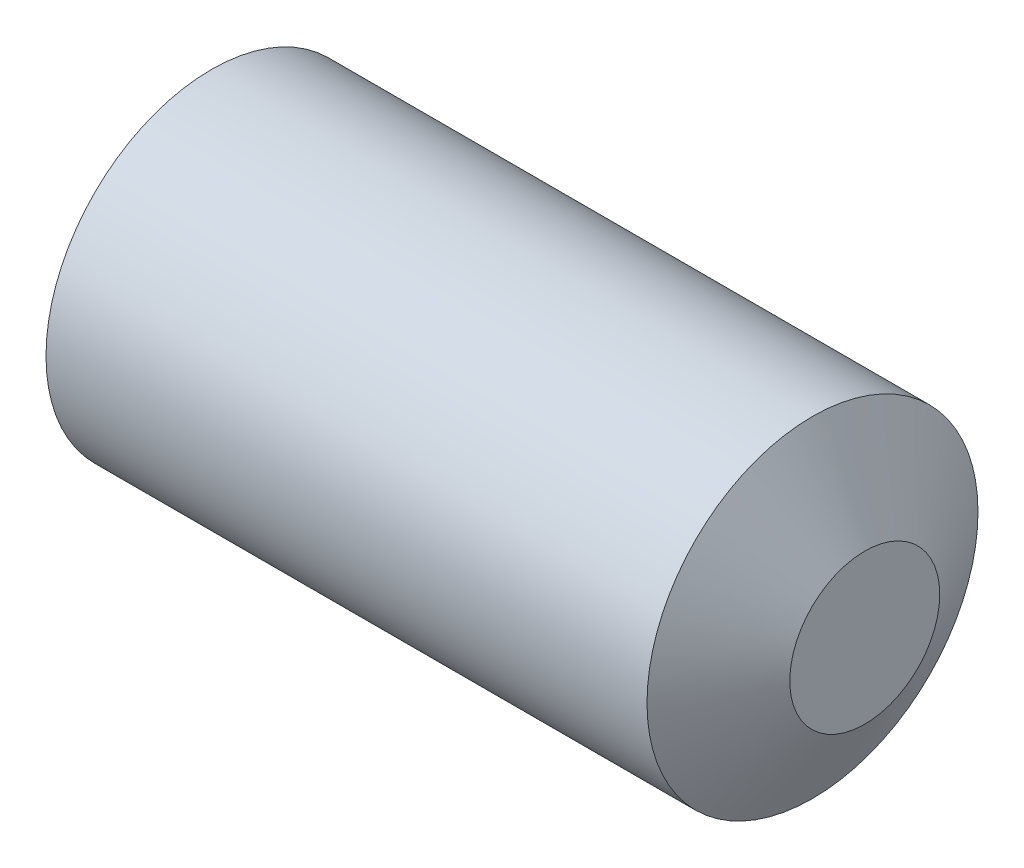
ISO-10303-21;
HEADER;
FILE_DESCRIPTION(('STEP AP214'),'2;1');
FILE_NAME('part.step','',(''),(''),'','','');
FILE_SCHEMA(('AUTOMOTIVE_DESIGN { 1 0 10303 214 1 1 1 1 }'));
ENDSEC;
DATA;
#1=APPLICATION_CONTEXT('core data for automotive mechanical design processes');
#2=APPLICATION_PROTOCOL_DEFINITION('international standard','automotive_design',2000,#1);
#3=PRODUCT_CONTEXT('',#1,'mechanical');
#4=PRODUCT('Part','Part','',(#3));
#5=PRODUCT_RELATED_PRODUCT_CATEGORY('part','',(#4));
#6=PRODUCT_DEFINITION_FORMATION('','',#4);
#7=PRODUCT_DEFINITION_CONTEXT('part definition',#1,'design');
#8=PRODUCT_DEFINITION('design','',#6,#7);
#9=PRODUCT_DEFINITION_SHAPE('','',#8);
#10=(LENGTH_UNIT() NAMED_UNIT(*) SI_UNIT(.MILLI.,.METRE.));
#11=(NAMED_UNIT(*) PLANE_ANGLE_UNIT() SI_UNIT($,.RADIAN.));
#12=(NAMED_UNIT(*) SI_UNIT($,.STERADIAN.) SOLID_ANGLE_UNIT());
#13=UNCERTAINTY_MEASURE_WITH_UNIT(LENGTH_MEASURE(1.E-05),#10,'distance_accuracy_value','');
#14=(GEOMETRIC_REPRESENTATION_CONTEXT(3) GLOBAL_UNCERTAINTY_ASSIGNED_CONTEXT((#13)) GLOBAL_UNIT_ASSIGNED_CONTEXT((#10,
#11,#12)) REPRESENTATION_CONTEXT('',''));
#15=CARTESIAN_POINT('',(0.,0.,0.));
#16=DIRECTION('',(0.,0.,1.));
#17=DIRECTION('',(1.,0.,0.));
#18=AXIS2_PLACEMENT_3D('',#15,#16,#17);
#19=CARTESIAN_POINT('',(0.,0.,0.));
#20=DIRECTION('',(1.,0.,0.));
#21=DIRECTION('',(0.,0.,-1.));
#22=AXIS2_PLACEMENT_3D('',#19,#20,#21);
#23=PLANE('',#22);
#24=CARTESIAN_POINT('',(0.,0.,0.));
#25=DIRECTION('',(1.,0.,0.));
#26=DIRECTION('',(0.,0.,-1.));
#27=AXIS2_PLACEMENT_3D('',#24,#25,#26);
#28=CIRCLE('',#27,1.09317728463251);
#29=CARTESIAN_POINT('',(0.,0.,-1.09317728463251));
#30=VERTEX_POINT('',#29);
#31=EDGE_CURVE('E11',#30,#30,#28,.T.);
#32=ORIENTED_EDGE('',*,*,#31,.T.);
#33=EDGE_LOOP('',(#32));
#34=FACE_BOUND('',#33,.T.);
#35=ADVANCED_FACE('F32',(#34),#23,.T.);
#36=CARTESIAN_POINT('',(0.,0.,0.));
#37=DIRECTION('',(-1.,0.,0.));
#38=DIRECTION('',(0.,0.,1.));
#39=AXIS2_PLACEMENT_3D('',#36,#37,#38);
#40=CONICAL_SURFACE('',#39,1.09317728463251,1.0471975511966);
#41=CARTESIAN_POINT('',(-0.762,0.,0.));
#42=DIRECTION('',(1.,0.,0.));
#43=DIRECTION('',(0.,0.,-1.));
#44=AXIS2_PLACEMENT_3D('',#41,#42,#43);
#45=CIRCLE('',#44,2.413);
#46=CARTESIAN_POINT('',(-0.762,0.,-2.413));
#47=VERTEX_POINT('',#46);
#48=EDGE_CURVE('E39',#47,#47,#45,.T.);
#49=ORIENTED_EDGE('',*,*,#48,.T.);
#50=EDGE_LOOP('',(#49));
#51=FACE_BOUND('',#50,.T.);
#52=ORIENTED_EDGE('',*,*,#31,.F.);
#53=EDGE_LOOP('',(#52));
#54=FACE_BOUND('',#53,.T.);
#55=ADVANCED_FACE('F143',(#51,#54),#40,.T.);
#56=CARTESIAN_POINT('',(0.,0.,0.));
#57=DIRECTION('',(1.,0.,0.));
#58=DIRECTION('',(0.,0.,-1.));
#59=AXIS2_PLACEMENT_3D('',#56,#57,#58);
#60=CYLINDRICAL_SURFACE('',#59,2.413);
#61=CARTESIAN_POINT('',(-9.525,0.,0.));
#62=DIRECTION('',(1.,0.,0.));
#63=DIRECTION('',(0.,0.,-1.));
#64=AXIS2_PLACEMENT_3D('',#61,#62,#63);
#65=CIRCLE('',#64,2.413);
#66=CARTESIAN_POINT('',(-9.525,0.,-2.413));
#67=VERTEX_POINT('',#66);
#68=EDGE_CURVE('E133',#67,#67,#65,.T.);
#69=ORIENTED_EDGE('',*,*,#68,.T.);
#70=EDGE_LOOP('',(#69));
#71=FACE_BOUND('',#70,.T.);
#72=ORIENTED_EDGE('',*,*,#48,.F.);
#73=EDGE_LOOP('',(#72));
#74=FACE_BOUND('',#73,.T.);
#75=ADVANCED_FACE('F146',(#71,#74),#60,.T.);
#76=CARTESIAN_POINT('',(-9.525,0.,-2.413));
#77=DIRECTION('',(-1.,0.,0.));
#78=DIRECTION('',(0.,0.,1.));
#79=AXIS2_PLACEMENT_3D('',#76,#77,#78);
#80=PLANE('',#79);
#81=DIRECTION('',(0.,-0.5,-0.866025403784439));
#82=VECTOR('',#81,1.);
#83=CARTESIAN_POINT('',(-9.525,0.687407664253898,-1.190625));
#84=LINE('',#83,#82);
#85=CARTESIAN_POINT('',(-9.525,1.3748153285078,0.));
#86=VERTEX_POINT('',#85);
#87=CARTESIAN_POINT('',(-9.525,0.687407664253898,-1.190625));
#88=VERTEX_POINT('',#87);
#89=EDGE_CURVE('E46',#86,#88,#84,.T.);
#90=ORIENTED_EDGE('',*,*,#89,.F.);
#91=DIRECTION('',(0.,0.5,-0.866025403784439));
#92=VECTOR('',#91,1.);
#93=CARTESIAN_POINT('',(-9.525,1.3748153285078,0.));
#94=LINE('',#93,#92);
#95=CARTESIAN_POINT('',(-9.525,0.687407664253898,1.190625));
#96=VERTEX_POINT('',#95);
#97=EDGE_CURVE('E129',#96,#86,#94,.T.);
#98=ORIENTED_EDGE('',*,*,#97,.F.);
#99=DIRECTION('',(0.,1.,0.));
#100=VECTOR('',#99,1.);
#101=CARTESIAN_POINT('',(-9.525,0.687407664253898,1.190625));
#102=LINE('',#101,#100);
#103=CARTESIAN_POINT('',(-9.525,-0.687407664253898,1.190625));
#104=VERTEX_POINT('',#103);
#105=EDGE_CURVE('E127',#104,#96,#102,.T.);
#106=ORIENTED_EDGE('',*,*,#105,.F.);
#107=DIRECTION('',(0.,0.5,0.866025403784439));
#108=VECTOR('',#107,1.);
#109=CARTESIAN_POINT('',(-9.525,-0.687407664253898,1.190625));
#110=LINE('',#109,#108);
#111=CARTESIAN_POINT('',(-9.525,-1.3748153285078,0.));
#112=VERTEX_POINT('',#111);
#113=EDGE_CURVE('E94',#112,#104,#110,.T.);
#114=ORIENTED_EDGE('',*,*,#113,.F.);
#115=DIRECTION('',(0.,-0.5,0.866025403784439));
#116=VECTOR('',#115,1.);
#117=CARTESIAN_POINT('',(-9.525,-1.3748153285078,0.));
#118=LINE('',#117,#116);
#119=CARTESIAN_POINT('',(-9.525,-0.687407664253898,-1.190625));
#120=VERTEX_POINT('',#119);
#121=EDGE_CURVE('E123',#120,#112,#118,.T.);
#122=ORIENTED_EDGE('',*,*,#121,.F.);
#123=DIRECTION('',(0.,-1.,0.));
#124=VECTOR('',#123,1.);
#125=CARTESIAN_POINT('',(-9.525,-0.687407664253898,-1.190625));
#126=LINE('',#125,#124);
#127=EDGE_CURVE('E120',#88,#120,#126,.T.);
#128=ORIENTED_EDGE('',*,*,#127,.F.);
#129=EDGE_LOOP('',(#90,#98,#106,#114,#122,#128));
#130=FACE_BOUND('',#129,.T.);
#131=ORIENTED_EDGE('',*,*,#68,.F.);
#132=EDGE_LOOP('',(#131));
#133=FACE_BOUND('',#132,.T.);
#134=ADVANCED_FACE('F148',(#130,#133),#80,.T.);
#135=CARTESIAN_POINT('',(-5.715,0.687407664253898,-1.190625));
#136=DIRECTION('',(0.,0.866025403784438,-0.5));
#137=DIRECTION('',(0.,0.5,0.866025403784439));
#138=AXIS2_PLACEMENT_3D('',#135,#136,#137);
#139=PLANE('',#138);
#140=ORIENTED_EDGE('',*,*,#89,.T.);
#141=DIRECTION('',(-1.,0.,0.));
#142=VECTOR('',#141,1.);
#143=CARTESIAN_POINT('',(-5.715,0.687407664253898,-1.190625));
#144=LINE('',#143,#142);
#145=CARTESIAN_POINT('',(-5.715,0.687407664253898,-1.190625));
#146=VERTEX_POINT('',#145);
#147=EDGE_CURVE('E76',#146,#88,#144,.T.);
#148=ORIENTED_EDGE('',*,*,#147,.F.);
#149=DIRECTION('',(0.,-0.5,-0.866025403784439));
#150=VECTOR('',#149,1.);
#151=CARTESIAN_POINT('',(-5.715,0.687407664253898,-1.190625));
#152=LINE('',#151,#150);
#153=CARTESIAN_POINT('',(-5.715,1.3748153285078,0.));
#154=VERTEX_POINT('',#153);
#155=EDGE_CURVE('E131',#154,#146,#152,.T.);
#156=ORIENTED_EDGE('',*,*,#155,.F.);
#157=DIRECTION('',(-1.,0.,0.));
#158=VECTOR('',#157,1.);
#159=CARTESIAN_POINT('',(-5.715,1.3748153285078,0.));
#160=LINE('',#159,#158);
#161=EDGE_CURVE('E54',#154,#86,#160,.T.);
#162=ORIENTED_EDGE('',*,*,#161,.T.);
#163=EDGE_LOOP('',(#140,#148,#156,#162));
#164=FACE_BOUND('',#163,.T.);
#165=ADVANCED_FACE('F155',(#164),#139,.F.);
#166=CARTESIAN_POINT('',(-5.715,1.3748153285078,0.));
#167=DIRECTION('',(0.,0.866025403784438,0.5));
#168=DIRECTION('',(0.,-0.5,0.866025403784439));
#169=AXIS2_PLACEMENT_3D('',#166,#167,#168);
#170=PLANE('',#169);
#171=ORIENTED_EDGE('',*,*,#97,.T.);
#172=ORIENTED_EDGE('',*,*,#161,.F.);
#173=DIRECTION('',(0.,0.5,-0.866025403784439));
#174=VECTOR('',#173,1.);
#175=CARTESIAN_POINT('',(-5.715,1.3748153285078,0.));
#176=LINE('',#175,#174);
#177=CARTESIAN_POINT('',(-5.715,0.687407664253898,1.190625));
#178=VERTEX_POINT('',#177);
#179=EDGE_CURVE('E106',#178,#154,#176,.T.);
#180=ORIENTED_EDGE('',*,*,#179,.F.);
#181=DIRECTION('',(-1.,0.,0.));
#182=VECTOR('',#181,1.);
#183=CARTESIAN_POINT('',(-5.715,0.687407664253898,1.190625));
#184=LINE('',#183,#182);
#185=EDGE_CURVE('E98',#178,#96,#184,.T.);
#186=ORIENTED_EDGE('',*,*,#185,.T.);
#187=EDGE_LOOP('',(#171,#172,#180,#186));
#188=FACE_BOUND('',#187,.T.);
#189=ADVANCED_FACE('F186',(#188),#170,.F.);
#190=CARTESIAN_POINT('',(-5.715,0.687407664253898,1.190625));
#191=DIRECTION('',(0.,0.,1.));
#192=DIRECTION('',(1.,0.,0.));
#193=AXIS2_PLACEMENT_3D('',#190,#191,#192);
#194=PLANE('',#193);
#195=ORIENTED_EDGE('',*,*,#105,.T.);
#196=ORIENTED_EDGE('',*,*,#185,.F.);
#197=DIRECTION('',(0.,1.,0.));
#198=VECTOR('',#197,1.);
#199=CARTESIAN_POINT('',(-5.715,0.687407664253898,1.190625));
#200=LINE('',#199,#198);
#201=CARTESIAN_POINT('',(-5.715,-0.687407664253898,1.190625));
#202=VERTEX_POINT('',#201);
#203=EDGE_CURVE('E102',#202,#178,#200,.T.);
#204=ORIENTED_EDGE('',*,*,#203,.F.);
#205=DIRECTION('',(-1.,0.,0.));
#206=VECTOR('',#205,1.);
#207=CARTESIAN_POINT('',(-5.715,-0.687407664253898,1.190625));
#208=LINE('',#207,#206);
#209=EDGE_CURVE('E87',#202,#104,#208,.T.);
#210=ORIENTED_EDGE('',*,*,#209,.T.);
#211=EDGE_LOOP('',(#195,#196,#204,#210));
#212=FACE_BOUND('',#211,.T.);
#213=ADVANCED_FACE('F103',(#212),#194,.F.);
#214=CARTESIAN_POINT('',(-5.715,-0.687407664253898,1.190625));
#215=DIRECTION('',(0.,-0.866025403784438,0.5));
#216=DIRECTION('',(0.,-0.5,-0.866025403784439));
#217=AXIS2_PLACEMENT_3D('',#214,#215,#216);
#218=PLANE('',#217);
#219=ORIENTED_EDGE('',*,*,#113,.T.);
#220=ORIENTED_EDGE('',*,*,#209,.F.);
#221=DIRECTION('',(0.,0.5,0.866025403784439));
#222=VECTOR('',#221,1.);
#223=CARTESIAN_POINT('',(-5.715,-0.687407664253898,1.190625));
#224=LINE('',#223,#222);
#225=CARTESIAN_POINT('',(-5.715,-1.3748153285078,0.));
#226=VERTEX_POINT('',#225);
#227=EDGE_CURVE('E91',#226,#202,#224,.T.);
#228=ORIENTED_EDGE('',*,*,#227,.F.);
#229=DIRECTION('',(-1.,0.,0.));
#230=VECTOR('',#229,1.);
#231=CARTESIAN_POINT('',(-5.715,-1.3748153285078,0.));
#232=LINE('',#231,#230);
#233=EDGE_CURVE('E99',#226,#112,#232,.T.);
#234=ORIENTED_EDGE('',*,*,#233,.T.);
#235=EDGE_LOOP('',(#219,#220,#228,#234));
#236=FACE_BOUND('',#235,.T.);
#237=ADVANCED_FACE('F89',(#236),#218,.F.);
#238=CARTESIAN_POINT('',(-5.715,-1.3748153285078,0.));
#239=DIRECTION('',(0.,-0.866025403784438,-0.5));
#240=DIRECTION('',(0.,0.5,-0.866025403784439));
#241=AXIS2_PLACEMENT_3D('',#238,#239,#240);
#242=PLANE('',#241);
#243=ORIENTED_EDGE('',*,*,#121,.T.);
#244=ORIENTED_EDGE('',*,*,#233,.F.);
#245=DIRECTION('',(0.,-0.5,0.866025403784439));
#246=VECTOR('',#245,1.);
#247=CARTESIAN_POINT('',(-5.715,-1.3748153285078,0.));
#248=LINE('',#247,#246);
#249=CARTESIAN_POINT('',(-5.715,-0.687407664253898,-1.190625));
#250=VERTEX_POINT('',#249);
#251=EDGE_CURVE('E112',#250,#226,#248,.T.);
#252=ORIENTED_EDGE('',*,*,#251,.F.);
#253=DIRECTION('',(-1.,0.,0.));
#254=VECTOR('',#253,1.);
#255=CARTESIAN_POINT('',(-5.715,-0.687407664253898,-1.190625));
#256=LINE('',#255,#254);
#257=EDGE_CURVE('E136',#250,#120,#256,.T.);
#258=ORIENTED_EDGE('',*,*,#257,.T.);
#259=EDGE_LOOP('',(#243,#244,#252,#258));
#260=FACE_BOUND('',#259,.T.);
#261=ADVANCED_FACE('F211',(#260),#242,.F.);
#262=CARTESIAN_POINT('',(-5.715,-0.687407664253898,-1.190625));
#263=DIRECTION('',(0.,0.,-1.));
#264=DIRECTION('',(-1.,0.,0.));
#265=AXIS2_PLACEMENT_3D('',#262,#263,#264);
#266=PLANE('',#265);
#267=ORIENTED_EDGE('',*,*,#127,.T.);
#268=ORIENTED_EDGE('',*,*,#257,.F.);
#269=DIRECTION('',(0.,-1.,0.));
#270=VECTOR('',#269,1.);
#271=CARTESIAN_POINT('',(-5.715,-0.687407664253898,-1.190625));
#272=LINE('',#271,#270);
#273=EDGE_CURVE('E114',#146,#250,#272,.T.);
#274=ORIENTED_EDGE('',*,*,#273,.F.);
#275=ORIENTED_EDGE('',*,*,#147,.T.);
#276=EDGE_LOOP('',(#267,#268,#274,#275));
#277=FACE_BOUND('',#276,.T.);
#278=ADVANCED_FACE('F220',(#277),#266,.F.);
#279=CARTESIAN_POINT('',(-5.715,1.3748153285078,0.));
#280=DIRECTION('',(1.,0.,0.));
#281=DIRECTION('',(0.,0.,-1.));
#282=AXIS2_PLACEMENT_3D('',#279,#280,#281);
#283=PLANE('',#282);
#284=ORIENTED_EDGE('',*,*,#155,.T.);
#285=ORIENTED_EDGE('',*,*,#273,.T.);
#286=ORIENTED_EDGE('',*,*,#251,.T.);
#287=ORIENTED_EDGE('',*,*,#227,.T.);
#288=ORIENTED_EDGE('',*,*,#203,.T.);
#289=ORIENTED_EDGE('',*,*,#179,.T.);
#290=EDGE_LOOP('',(#284,#285,#286,#287,#288,#289));
#291=FACE_BOUND('',#290,.T.);
#292=ADVANCED_FACE('F109',(#291),#283,.F.);
#293=CLOSED_SHELL('',(#35,#55,#75,#134,#165,#189,#213,#237,#261,#278,#292));
#294=MANIFOLD_SOLID_BREP('B2',#293);
#295=ADVANCED_BREP_SHAPE_REPRESENTATION('',(#18,#294),#14);
#296=SHAPE_DEFINITION_REPRESENTATION(#9,#295);
ENDSEC;
END-ISO-10303-21;
